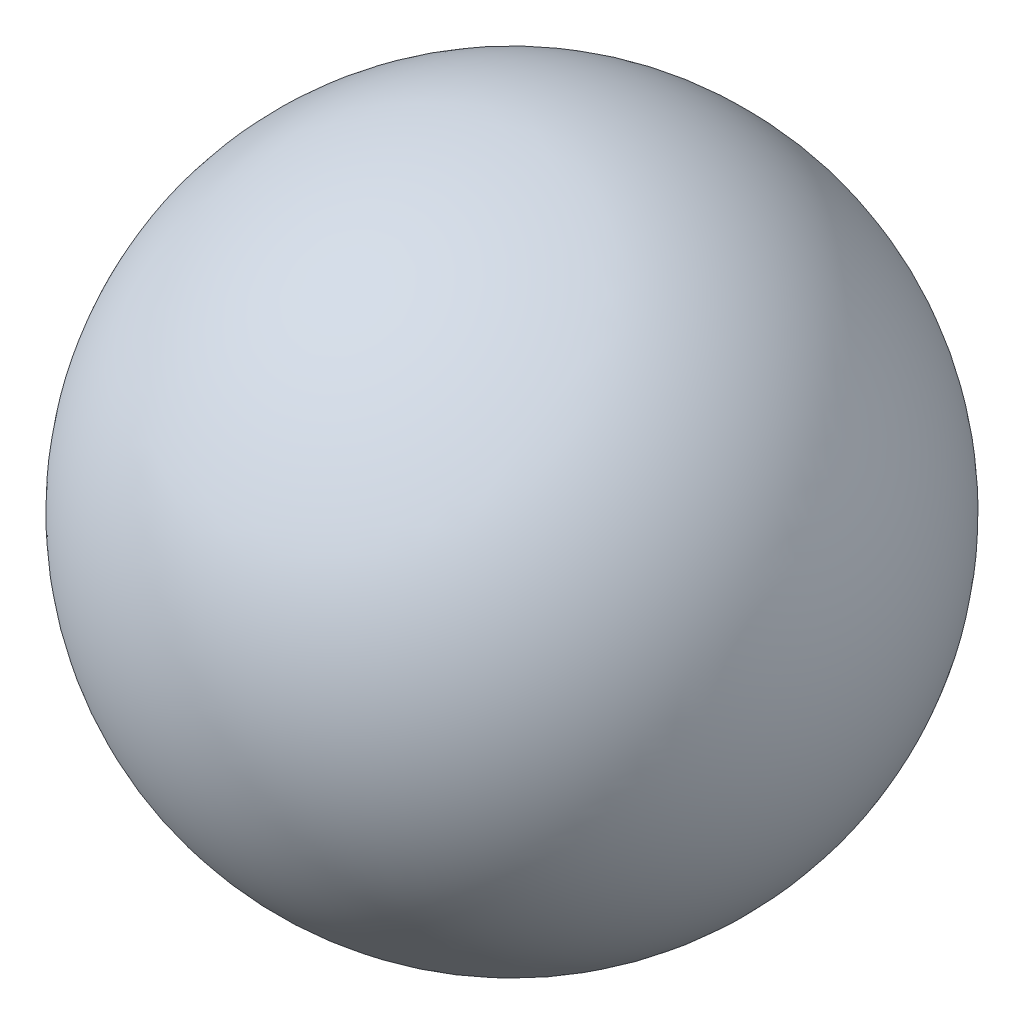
from build123d import *


with BuildPart() as part:
    # Esquisse1 → Base-R_volution (revolve)
    with BuildSketch(Plane.XY):
        with BuildLine():
            Line((3.95, 0), (-3.95, 0))
            ThreePointArc((-3.95, 0), (0, 3.95), (3.95, 0))
        make_face()
    revolve(axis=Axis((0, 0, 0), (1, 0, 0)))


solid = part.part
